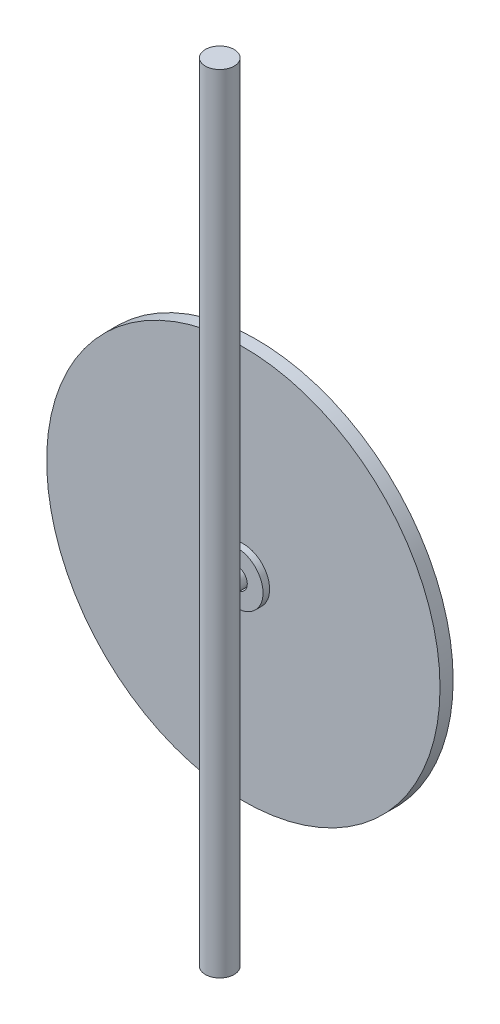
ISO-10303-21;
HEADER;
FILE_DESCRIPTION(('STEP AP214'),'2;1');
FILE_NAME('part.step','',(''),(''),'','','');
FILE_SCHEMA(('AUTOMOTIVE_DESIGN { 1 0 10303 214 1 1 1 1 }'));
ENDSEC;
DATA;
#1=APPLICATION_CONTEXT('core data for automotive mechanical design processes');
#2=APPLICATION_PROTOCOL_DEFINITION('international standard','automotive_design',2000,#1);
#3=PRODUCT_CONTEXT('',#1,'mechanical');
#4=PRODUCT('Part','Part','',(#3));
#5=PRODUCT_RELATED_PRODUCT_CATEGORY('part','',(#4));
#6=PRODUCT_DEFINITION_FORMATION('','',#4);
#7=PRODUCT_DEFINITION_CONTEXT('part definition',#1,'design');
#8=PRODUCT_DEFINITION('design','',#6,#7);
#9=PRODUCT_DEFINITION_SHAPE('','',#8);
#10=(LENGTH_UNIT() NAMED_UNIT(*) SI_UNIT(.MILLI.,.METRE.));
#11=(NAMED_UNIT(*) PLANE_ANGLE_UNIT() SI_UNIT($,.RADIAN.));
#12=(NAMED_UNIT(*) SI_UNIT($,.STERADIAN.) SOLID_ANGLE_UNIT());
#13=UNCERTAINTY_MEASURE_WITH_UNIT(LENGTH_MEASURE(1.E-05),#10,'distance_accuracy_value','');
#14=(GEOMETRIC_REPRESENTATION_CONTEXT(3) GLOBAL_UNCERTAINTY_ASSIGNED_CONTEXT((#13)) GLOBAL_UNIT_ASSIGNED_CONTEXT((#10,
#11,#12)) REPRESENTATION_CONTEXT('',''));
#15=CARTESIAN_POINT('',(0.,0.,0.));
#16=DIRECTION('',(0.,0.,1.));
#17=DIRECTION('',(1.,0.,0.));
#18=AXIS2_PLACEMENT_3D('',#15,#16,#17);
#19=CARTESIAN_POINT('',(99.9872894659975,-45.8993376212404,629.999999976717));
#20=DIRECTION('',(0.,0.,-1.));
#21=DIRECTION('',(-1.,0.,0.));
#22=AXIS2_PLACEMENT_3D('',#19,#20,#21);
#23=CYLINDRICAL_SURFACE('',#22,7.);
#24=CARTESIAN_POINT('',(99.9872894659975,-45.8993376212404,629.999999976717));
#25=DIRECTION('',(0.,0.,1.));
#26=DIRECTION('',(1.,0.,0.));
#27=AXIS2_PLACEMENT_3D('',#24,#25,#26);
#28=CIRCLE('',#27,7.);
#29=CARTESIAN_POINT('',(92.9872894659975,-45.8993376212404,629.999999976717));
#30=VERTEX_POINT('',#29);
#31=EDGE_CURVE('P0_E9',#30,#30,#28,.T.);
#32=CARTESIAN_POINT('',(99.9872894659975,-45.8993376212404,614.999999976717));
#33=DIRECTION('',(0.,0.,1.));
#34=DIRECTION('',(1.,0.,0.));
#35=AXIS2_PLACEMENT_3D('',#32,#33,#34);
#36=CIRCLE('',#35,7.);
#37=CARTESIAN_POINT('',(92.9872894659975,-45.8993376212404,614.999999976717));
#38=VERTEX_POINT('',#37);
#39=EDGE_CURVE('P0_E16',#38,#38,#36,.T.);
#40=CARTESIAN_POINT('',(92.9872894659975,-45.8993376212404,629.999999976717));
#41=CARTESIAN_POINT('',(92.9872894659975,-45.8993376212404,629.843749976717));
#42=CARTESIAN_POINT('',(92.9872894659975,-45.8993376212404,629.687499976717));
#43=CARTESIAN_POINT('',(92.9872894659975,-45.8993376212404,629.374999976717));
#44=CARTESIAN_POINT('',(92.9872894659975,-45.8993376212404,629.218749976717));
#45=CARTESIAN_POINT('',(92.9872894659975,-45.8993376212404,628.906249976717));
#46=CARTESIAN_POINT('',(92.9872894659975,-45.8993376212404,628.749999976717));
#47=CARTESIAN_POINT('',(92.9872894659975,-45.8993376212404,628.437499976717));
#48=CARTESIAN_POINT('',(92.9872894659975,-45.8993376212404,628.281249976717));
#49=CARTESIAN_POINT('',(92.9872894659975,-45.8993376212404,627.968749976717));
#50=CARTESIAN_POINT('',(92.9872894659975,-45.8993376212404,627.812499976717));
#51=CARTESIAN_POINT('',(92.9872894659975,-45.8993376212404,627.499999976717));
#52=CARTESIAN_POINT('',(92.9872894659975,-45.8993376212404,627.343749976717));
#53=CARTESIAN_POINT('',(92.9872894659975,-45.8993376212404,627.031249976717));
#54=CARTESIAN_POINT('',(92.9872894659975,-45.8993376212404,626.874999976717));
#55=CARTESIAN_POINT('',(92.9872894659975,-45.8993376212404,626.562499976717));
#56=CARTESIAN_POINT('',(92.9872894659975,-45.8993376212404,626.406249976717));
#57=CARTESIAN_POINT('',(92.9872894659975,-45.8993376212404,626.093749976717));
#58=CARTESIAN_POINT('',(92.9872894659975,-45.8993376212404,625.937499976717));
#59=CARTESIAN_POINT('',(92.9872894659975,-45.8993376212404,625.624999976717));
#60=CARTESIAN_POINT('',(92.9872894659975,-45.8993376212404,625.468749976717));
#61=CARTESIAN_POINT('',(92.9872894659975,-45.8993376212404,625.156249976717));
#62=CARTESIAN_POINT('',(92.9872894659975,-45.8993376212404,624.999999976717));
#63=CARTESIAN_POINT('',(92.9872894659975,-45.8993376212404,624.687499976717));
#64=CARTESIAN_POINT('',(92.9872894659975,-45.8993376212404,624.531249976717));
#65=CARTESIAN_POINT('',(92.9872894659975,-45.8993376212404,624.218749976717));
#66=CARTESIAN_POINT('',(92.9872894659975,-45.8993376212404,624.062499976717));
#67=CARTESIAN_POINT('',(92.9872894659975,-45.8993376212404,623.749999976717));
#68=CARTESIAN_POINT('',(92.9872894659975,-45.8993376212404,623.593749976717));
#69=CARTESIAN_POINT('',(92.9872894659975,-45.8993376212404,623.281249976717));
#70=CARTESIAN_POINT('',(92.9872894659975,-45.8993376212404,623.124999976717));
#71=CARTESIAN_POINT('',(92.9872894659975,-45.8993376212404,622.812499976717));
#72=CARTESIAN_POINT('',(92.9872894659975,-45.8993376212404,622.656249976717));
#73=CARTESIAN_POINT('',(92.9872894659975,-45.8993376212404,622.343749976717));
#74=CARTESIAN_POINT('',(92.9872894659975,-45.8993376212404,622.187499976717));
#75=CARTESIAN_POINT('',(92.9872894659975,-45.8993376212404,621.874999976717));
#76=CARTESIAN_POINT('',(92.9872894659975,-45.8993376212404,621.718749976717));
#77=CARTESIAN_POINT('',(92.9872894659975,-45.8993376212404,621.406249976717));
#78=CARTESIAN_POINT('',(92.9872894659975,-45.8993376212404,621.249999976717));
#79=CARTESIAN_POINT('',(92.9872894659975,-45.8993376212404,620.937499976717));
#80=CARTESIAN_POINT('',(92.9872894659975,-45.8993376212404,620.781249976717));
#81=CARTESIAN_POINT('',(92.9872894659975,-45.8993376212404,620.468749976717));
#82=CARTESIAN_POINT('',(92.9872894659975,-45.8993376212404,620.312499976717));
#83=CARTESIAN_POINT('',(92.9872894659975,-45.8993376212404,619.999999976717));
#84=CARTESIAN_POINT('',(92.9872894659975,-45.8993376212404,619.843749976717));
#85=CARTESIAN_POINT('',(92.9872894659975,-45.8993376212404,619.531249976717));
#86=CARTESIAN_POINT('',(92.9872894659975,-45.8993376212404,619.374999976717));
#87=CARTESIAN_POINT('',(92.9872894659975,-45.8993376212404,619.062499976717));
#88=CARTESIAN_POINT('',(92.9872894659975,-45.8993376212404,618.906249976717));
#89=CARTESIAN_POINT('',(92.9872894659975,-45.8993376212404,618.593749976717));
#90=CARTESIAN_POINT('',(92.9872894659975,-45.8993376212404,618.437499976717));
#91=CARTESIAN_POINT('',(92.9872894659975,-45.8993376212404,618.124999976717));
#92=CARTESIAN_POINT('',(92.9872894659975,-45.8993376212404,617.968749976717));
#93=CARTESIAN_POINT('',(92.9872894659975,-45.8993376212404,617.656249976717));
#94=CARTESIAN_POINT('',(92.9872894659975,-45.8993376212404,617.499999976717));
#95=CARTESIAN_POINT('',(92.9872894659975,-45.8993376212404,617.187499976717));
#96=CARTESIAN_POINT('',(92.9872894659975,-45.8993376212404,617.031249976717));
#97=CARTESIAN_POINT('',(92.9872894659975,-45.8993376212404,616.718749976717));
#98=CARTESIAN_POINT('',(92.9872894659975,-45.8993376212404,616.562499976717));
#99=CARTESIAN_POINT('',(92.9872894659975,-45.8993376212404,616.249999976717));
#100=CARTESIAN_POINT('',(92.9872894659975,-45.8993376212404,616.093749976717));
#101=CARTESIAN_POINT('',(92.9872894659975,-45.8993376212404,615.781249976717));
#102=CARTESIAN_POINT('',(92.9872894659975,-45.8993376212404,615.624999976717));
#103=CARTESIAN_POINT('',(92.9872894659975,-45.8993376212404,615.312499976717));
#104=CARTESIAN_POINT('',(92.9872894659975,-45.8993376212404,615.156249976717));
#105=CARTESIAN_POINT('',(92.9872894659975,-45.8993376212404,614.999999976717));
#106=B_SPLINE_CURVE_WITH_KNOTS('',3,(#40,#41,#42,#43,#44,#45,#46,#47,#48,#49,#50,#51,#52,#53,
#54,#55,#56,#57,#58,#59,#60,#61,#62,#63,#64,#65,#66,#67,#68,#69,#70,#71,#72,#73,#74,#75,#76,#77,
#78,#79,#80,#81,#82,#83,#84,#85,#86,#87,#88,#89,#90,#91,#92,#93,#94,#95,#96,#97,#98,#99,#100,
#101,#102,#103,#104,#105),.UNSPECIFIED.,.F.,.F.,(4,2,2,2,2,2,2,2,2,2,2,2,2,2,2,2,2,2,2,2,2,2,2,
2,2,2,2,2,2,2,2,2,4),(0.,0.468749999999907,0.937499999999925,1.40624999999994,1.87499999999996,
2.34374999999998,2.8125,3.2812499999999,3.74999999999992,4.21874999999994,4.68749999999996,
5.15624999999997,5.62499999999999,6.0937499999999,6.56249999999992,7.03124999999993,
7.49999999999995,7.96874999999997,8.43749999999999,8.90625,9.37499999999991,9.84374999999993,
10.3124999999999,10.78125,11.25,11.71875,12.1874999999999,12.6562499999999,13.1249999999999,
13.59375,14.0625,14.53125,14.9999999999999),.UNSPECIFIED.);
#107=EDGE_CURVE('P0_BSEAM13',#30,#38,#106,.T.);
#108=ORIENTED_EDGE('',*,*,#31,.F.);
#109=ORIENTED_EDGE('',*,*,#39,.T.);
#110=ORIENTED_EDGE('',*,*,#107,.T.);
#111=ORIENTED_EDGE('',*,*,#107,.F.);
#112=EDGE_LOOP('',(#108,#110,#109,#111));
#113=FACE_BOUND('',#112,.T.);
#114=ADVANCED_FACE('P0_F13',(#113),#23,.T.);
#115=CARTESIAN_POINT('',(99.9872894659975,-45.8993376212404,629.999999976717));
#116=DIRECTION('',(0.,0.,1.));
#117=DIRECTION('',(1.,0.,0.));
#118=AXIS2_PLACEMENT_3D('',#115,#116,#117);
#119=PLANE('',#118);
#120=CARTESIAN_POINT('',(99.9872894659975,-45.8993376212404,629.999999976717));
#121=DIRECTION('',(0.,0.,1.));
#122=DIRECTION('',(1.,0.,0.));
#123=AXIS2_PLACEMENT_3D('',#120,#121,#122);
#124=CIRCLE('',#123,6.);
#125=CARTESIAN_POINT('',(105.987289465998,-45.8993376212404,629.999999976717));
#126=VERTEX_POINT('',#125);
#127=EDGE_CURVE('P0_E25',#126,#126,#124,.T.);
#128=ORIENTED_EDGE('',*,*,#127,.F.);
#129=EDGE_LOOP('',(#128));
#130=FACE_BOUND('',#129,.T.);
#131=ORIENTED_EDGE('',*,*,#31,.T.);
#132=EDGE_LOOP('',(#131));
#133=FACE_BOUND('',#132,.T.);
#134=ADVANCED_FACE('P0_F40',(#130,#133),#119,.T.);
#135=CARTESIAN_POINT('',(99.9872894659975,-45.8993376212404,614.999999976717));
#136=DIRECTION('',(0.,0.,1.));
#137=DIRECTION('',(1.,0.,0.));
#138=AXIS2_PLACEMENT_3D('',#135,#136,#137);
#139=PLANE('',#138);
#140=ORIENTED_EDGE('',*,*,#39,.F.);
#141=EDGE_LOOP('',(#140));
#142=FACE_BOUND('',#141,.T.);
#143=ADVANCED_FACE('P0_F36',(#142),#139,.F.);
#144=CARTESIAN_POINT('',(99.9872894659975,-45.8993376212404,619.999999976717));
#145=DIRECTION('',(0.,0.,1.));
#146=DIRECTION('',(1.,0.,0.));
#147=AXIS2_PLACEMENT_3D('',#144,#145,#146);
#148=CYLINDRICAL_SURFACE('',#147,6.);
#149=CARTESIAN_POINT('',(99.9872894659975,-45.8993376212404,619.999999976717));
#150=DIRECTION('',(0.,0.,1.));
#151=DIRECTION('',(1.,0.,0.));
#152=AXIS2_PLACEMENT_3D('',#149,#150,#151);
#153=CIRCLE('',#152,6.);
#154=CARTESIAN_POINT('',(105.987289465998,-45.8993376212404,619.999999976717));
#155=VERTEX_POINT('',#154);
#156=EDGE_CURVE('P0_E23',#155,#155,#153,.T.);
#157=ORIENTED_EDGE('',*,*,#156,.F.);
#158=EDGE_LOOP('',(#157));
#159=FACE_BOUND('',#158,.T.);
#160=ORIENTED_EDGE('',*,*,#127,.T.);
#161=EDGE_LOOP('',(#160));
#162=FACE_BOUND('',#161,.T.);
#163=ADVANCED_FACE('P0_F33',(#159,#162),#148,.F.);
#164=CARTESIAN_POINT('',(99.9872894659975,-45.8993376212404,619.999999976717));
#165=DIRECTION('',(0.,0.,1.));
#166=DIRECTION('',(1.,0.,0.));
#167=AXIS2_PLACEMENT_3D('',#164,#165,#166);
#168=PLANE('',#167);
#169=ORIENTED_EDGE('',*,*,#156,.T.);
#170=EDGE_LOOP('',(#169));
#171=FACE_BOUND('',#170,.T.);
#172=ADVANCED_FACE('P0_F31',(#171),#168,.T.);
#173=CLOSED_SHELL('',(#114,#134,#143,#163,#172));
#174=MANIFOLD_SOLID_BREP('P0_B1',#173);
#175=CARTESIAN_POINT('',(99.9872894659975,-45.8993376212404,624.999999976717));
#176=DIRECTION('',(0.,0.,1.));
#177=DIRECTION('',(1.,0.,0.));
#178=AXIS2_PLACEMENT_3D('',#175,#176,#177);
#179=PLANE('',#178);
#180=CARTESIAN_POINT('',(99.9872894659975,-45.8993376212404,624.999999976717));
#181=DIRECTION('',(0.,0.,1.));
#182=DIRECTION('',(1.,0.,0.));
#183=AXIS2_PLACEMENT_3D('',#180,#181,#182);
#184=CIRCLE('',#183,20.);
#185=CARTESIAN_POINT('',(119.987289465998,-45.8993376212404,624.999999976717));
#186=VERTEX_POINT('',#185);
#187=EDGE_CURVE('P1_E10',#186,#186,#184,.T.);
#188=ORIENTED_EDGE('',*,*,#187,.T.);
#189=EDGE_LOOP('',(#188));
#190=FACE_BOUND('',#189,.T.);
#191=CARTESIAN_POINT('',(99.9872894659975,-45.8993376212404,624.999999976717));
#192=DIRECTION('',(0.,0.,1.));
#193=DIRECTION('',(1.,0.,0.));
#194=AXIS2_PLACEMENT_3D('',#191,#192,#193);
#195=CIRCLE('',#194,8.);
#196=CARTESIAN_POINT('',(107.987289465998,-45.8993376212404,624.999999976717));
#197=VERTEX_POINT('',#196);
#198=EDGE_CURVE('P1_E25',#197,#197,#195,.T.);
#199=ORIENTED_EDGE('',*,*,#198,.F.);
#200=EDGE_LOOP('',(#199));
#201=FACE_BOUND('',#200,.T.);
#202=ADVANCED_FACE('P1_F14',(#190,#201),#179,.T.);
#203=CARTESIAN_POINT('',(99.9872894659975,-45.8993376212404,619.999999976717));
#204=DIRECTION('',(0.,0.,1.));
#205=DIRECTION('',(1.,0.,0.));
#206=AXIS2_PLACEMENT_3D('',#203,#204,#205);
#207=PLANE('',#206);
#208=CARTESIAN_POINT('',(99.9872894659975,-45.8993376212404,619.999999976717));
#209=DIRECTION('',(0.,0.,1.));
#210=DIRECTION('',(1.,0.,0.));
#211=AXIS2_PLACEMENT_3D('',#208,#209,#210);
#212=CIRCLE('',#211,20.);
#213=CARTESIAN_POINT('',(119.987289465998,-45.8993376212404,619.999999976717));
#214=VERTEX_POINT('',#213);
#215=EDGE_CURVE('P1_E18',#214,#214,#212,.T.);
#216=ORIENTED_EDGE('',*,*,#215,.F.);
#217=EDGE_LOOP('',(#216));
#218=FACE_BOUND('',#217,.T.);
#219=CARTESIAN_POINT('',(99.9872894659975,-45.8993376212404,619.999999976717));
#220=DIRECTION('',(0.,0.,1.));
#221=DIRECTION('',(1.,0.,0.));
#222=AXIS2_PLACEMENT_3D('',#219,#220,#221);
#223=CIRCLE('',#222,8.);
#224=CARTESIAN_POINT('',(107.987289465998,-45.8993376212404,619.999999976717));
#225=VERTEX_POINT('',#224);
#226=EDGE_CURVE('P1_E27',#225,#225,#223,.T.);
#227=ORIENTED_EDGE('',*,*,#226,.T.);
#228=EDGE_LOOP('',(#227));
#229=FACE_BOUND('',#228,.T.);
#230=ADVANCED_FACE('P1_F37',(#218,#229),#207,.F.);
#231=CARTESIAN_POINT('',(99.9872894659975,-45.8993376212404,624.999999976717));
#232=DIRECTION('',(0.,0.,-1.));
#233=DIRECTION('',(-1.,0.,0.));
#234=AXIS2_PLACEMENT_3D('',#231,#232,#233);
#235=CYLINDRICAL_SURFACE('',#234,20.);
#236=ORIENTED_EDGE('',*,*,#187,.F.);
#237=EDGE_LOOP('',(#236));
#238=FACE_BOUND('',#237,.T.);
#239=ORIENTED_EDGE('',*,*,#215,.T.);
#240=EDGE_LOOP('',(#239));
#241=FACE_BOUND('',#240,.T.);
#242=ADVANCED_FACE('P1_F16',(#238,#241),#235,.T.);
#243=CARTESIAN_POINT('',(99.9872894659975,-45.8993376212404,624.999999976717));
#244=DIRECTION('',(0.,0.,-1.));
#245=DIRECTION('',(-1.,0.,0.));
#246=AXIS2_PLACEMENT_3D('',#243,#244,#245);
#247=CYLINDRICAL_SURFACE('',#246,8.);
#248=ORIENTED_EDGE('',*,*,#198,.T.);
#249=EDGE_LOOP('',(#248));
#250=FACE_BOUND('',#249,.T.);
#251=ORIENTED_EDGE('',*,*,#226,.F.);
#252=EDGE_LOOP('',(#251));
#253=FACE_BOUND('',#252,.T.);
#254=ADVANCED_FACE('P1_F33',(#250,#253),#247,.F.);
#255=CLOSED_SHELL('',(#202,#230,#242,#254));
#256=MANIFOLD_SOLID_BREP('P1_B1',#255);
#257=CARTESIAN_POINT('',(99.9872894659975,-45.8993376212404,619.999999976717));
#258=DIRECTION('',(0.,0.,-1.));
#259=DIRECTION('',(-1.,0.,0.));
#260=AXIS2_PLACEMENT_3D('',#257,#258,#259);
#261=CYLINDRICAL_SURFACE('',#260,150.);
#262=CARTESIAN_POINT('',(99.9872894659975,-45.8993376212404,619.999999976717));
#263=DIRECTION('',(0.,0.,1.));
#264=DIRECTION('',(1.,0.,0.));
#265=AXIS2_PLACEMENT_3D('',#262,#263,#264);
#266=CIRCLE('',#265,150.);
#267=CARTESIAN_POINT('',(249.987289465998,-45.8993376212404,619.999999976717));
#268=VERTEX_POINT('',#267);
#269=EDGE_CURVE('P2_E10',#268,#268,#266,.T.);
#270=ORIENTED_EDGE('',*,*,#269,.F.);
#271=EDGE_LOOP('',(#270));
#272=FACE_BOUND('',#271,.T.);
#273=CARTESIAN_POINT('',(99.9872894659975,-45.8993376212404,609.999999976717));
#274=DIRECTION('',(0.,0.,1.));
#275=DIRECTION('',(1.,0.,0.));
#276=AXIS2_PLACEMENT_3D('',#273,#274,#275);
#277=CIRCLE('',#276,150.);
#278=CARTESIAN_POINT('',(249.987289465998,-45.8993376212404,609.999999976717));
#279=VERTEX_POINT('',#278);
#280=EDGE_CURVE('P2_E17',#279,#279,#277,.T.);
#281=ORIENTED_EDGE('',*,*,#280,.T.);
#282=EDGE_LOOP('',(#281));
#283=FACE_BOUND('',#282,.T.);
#284=ADVANCED_FACE('P2_F14',(#272,#283),#261,.T.);
#285=CARTESIAN_POINT('',(99.9872894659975,-45.8993376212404,619.999999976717));
#286=DIRECTION('',(0.,0.,1.));
#287=DIRECTION('',(1.,0.,0.));
#288=AXIS2_PLACEMENT_3D('',#285,#286,#287);
#289=PLANE('',#288);
#290=CARTESIAN_POINT('',(99.9872894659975,-45.8993376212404,619.999999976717));
#291=DIRECTION('',(0.,0.,1.));
#292=DIRECTION('',(1.,0.,0.));
#293=AXIS2_PLACEMENT_3D('',#290,#291,#292);
#294=CIRCLE('',#293,7.);
#295=CARTESIAN_POINT('',(106.987289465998,-45.8993376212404,619.999999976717));
#296=VERTEX_POINT('',#295);
#297=EDGE_CURVE('P2_E26',#296,#296,#294,.T.);
#298=ORIENTED_EDGE('',*,*,#297,.F.);
#299=EDGE_LOOP('',(#298));
#300=FACE_BOUND('',#299,.T.);
#301=ORIENTED_EDGE('',*,*,#269,.T.);
#302=EDGE_LOOP('',(#301));
#303=FACE_BOUND('',#302,.T.);
#304=ADVANCED_FACE('P2_F41',(#300,#303),#289,.T.);
#305=CARTESIAN_POINT('',(99.9872894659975,-45.8993376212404,609.999999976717));
#306=DIRECTION('',(0.,0.,1.));
#307=DIRECTION('',(1.,0.,0.));
#308=AXIS2_PLACEMENT_3D('',#305,#306,#307);
#309=PLANE('',#308);
#310=ORIENTED_EDGE('',*,*,#280,.F.);
#311=EDGE_LOOP('',(#310));
#312=FACE_BOUND('',#311,.T.);
#313=ADVANCED_FACE('P2_F37',(#312),#309,.F.);
#314=CARTESIAN_POINT('',(99.9872894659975,-45.8993376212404,614.999999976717));
#315=DIRECTION('',(0.,0.,1.));
#316=DIRECTION('',(1.,0.,0.));
#317=AXIS2_PLACEMENT_3D('',#314,#315,#316);
#318=CYLINDRICAL_SURFACE('',#317,7.);
#319=CARTESIAN_POINT('',(99.9872894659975,-45.8993376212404,614.999999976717));
#320=DIRECTION('',(0.,0.,1.));
#321=DIRECTION('',(1.,0.,0.));
#322=AXIS2_PLACEMENT_3D('',#319,#320,#321);
#323=CIRCLE('',#322,7.);
#324=CARTESIAN_POINT('',(106.987289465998,-45.8993376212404,614.999999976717));
#325=VERTEX_POINT('',#324);
#326=EDGE_CURVE('P2_E24',#325,#325,#323,.T.);
#327=ORIENTED_EDGE('',*,*,#326,.F.);
#328=EDGE_LOOP('',(#327));
#329=FACE_BOUND('',#328,.T.);
#330=ORIENTED_EDGE('',*,*,#297,.T.);
#331=EDGE_LOOP('',(#330));
#332=FACE_BOUND('',#331,.T.);
#333=ADVANCED_FACE('P2_F34',(#329,#332),#318,.F.);
#334=CARTESIAN_POINT('',(99.9872894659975,-45.8993376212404,614.999999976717));
#335=DIRECTION('',(0.,0.,1.));
#336=DIRECTION('',(1.,0.,0.));
#337=AXIS2_PLACEMENT_3D('',#334,#335,#336);
#338=PLANE('',#337);
#339=ORIENTED_EDGE('',*,*,#326,.T.);
#340=EDGE_LOOP('',(#339));
#341=FACE_BOUND('',#340,.T.);
#342=ADVANCED_FACE('P2_F32',(#341),#338,.T.);
#343=CLOSED_SHELL('',(#284,#304,#313,#333,#342));
#344=MANIFOLD_SOLID_BREP('P2_B1',#343);
#345=CARTESIAN_POINT('',(99.9872894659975,-45.8993376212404,609.999999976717));
#346=DIRECTION('',(0.,0.,-1.));
#347=DIRECTION('',(-1.,0.,0.));
#348=AXIS2_PLACEMENT_3D('',#345,#346,#347);
#349=CYLINDRICAL_SURFACE('',#348,25.);
#350=CARTESIAN_POINT('',(99.9872894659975,-45.8993376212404,609.999999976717));
#351=DIRECTION('',(0.,0.,1.));
#352=DIRECTION('',(1.,0.,0.));
#353=AXIS2_PLACEMENT_3D('',#350,#351,#352);
#354=CIRCLE('',#353,25.);
#355=CARTESIAN_POINT('',(124.987289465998,-45.8993376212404,609.999999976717));
#356=VERTEX_POINT('',#355);
#357=EDGE_CURVE('P3_E10',#356,#356,#354,.T.);
#358=ORIENTED_EDGE('',*,*,#357,.F.);
#359=EDGE_LOOP('',(#358));
#360=FACE_BOUND('',#359,.T.);
#361=CARTESIAN_POINT('',(99.9872894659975,-45.8993376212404,599.999999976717));
#362=DIRECTION('',(0.,0.,1.));
#363=DIRECTION('',(1.,0.,0.));
#364=AXIS2_PLACEMENT_3D('',#361,#362,#363);
#365=CIRCLE('',#364,25.);
#366=CARTESIAN_POINT('',(124.987289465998,-45.8993376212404,599.999999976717));
#367=VERTEX_POINT('',#366);
#368=EDGE_CURVE('P3_E17',#367,#367,#365,.T.);
#369=ORIENTED_EDGE('',*,*,#368,.T.);
#370=EDGE_LOOP('',(#369));
#371=FACE_BOUND('',#370,.T.);
#372=ADVANCED_FACE('P3_F14',(#360,#371),#349,.T.);
#373=CARTESIAN_POINT('',(99.9872894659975,-45.8993376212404,609.999999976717));
#374=DIRECTION('',(0.,0.,1.));
#375=DIRECTION('',(1.,0.,0.));
#376=AXIS2_PLACEMENT_3D('',#373,#374,#375);
#377=PLANE('',#376);
#378=ORIENTED_EDGE('',*,*,#357,.T.);
#379=EDGE_LOOP('',(#378));
#380=FACE_BOUND('',#379,.T.);
#381=ADVANCED_FACE('P3_F29',(#380),#377,.T.);
#382=CARTESIAN_POINT('',(99.9872894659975,-45.8993376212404,599.999999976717));
#383=DIRECTION('',(0.,0.,1.));
#384=DIRECTION('',(1.,0.,0.));
#385=AXIS2_PLACEMENT_3D('',#382,#383,#384);
#386=PLANE('',#385);
#387=ORIENTED_EDGE('',*,*,#368,.F.);
#388=EDGE_LOOP('',(#387));
#389=FACE_BOUND('',#388,.T.);
#390=ADVANCED_FACE('P3_F27',(#389),#386,.F.);
#391=CLOSED_SHELL('',(#372,#381,#390));
#392=MANIFOLD_SOLID_BREP('P3_B1',#391);
#393=CARTESIAN_POINT('',(99.9872894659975,-45.8993376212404,599.999999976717));
#394=DIRECTION('',(0.,0.,-1.));
#395=DIRECTION('',(-1.,0.,0.));
#396=AXIS2_PLACEMENT_3D('',#393,#394,#395);
#397=CYLINDRICAL_SURFACE('',#396,75.);
#398=CARTESIAN_POINT('',(99.9872894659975,-45.8993376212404,599.999999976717));
#399=DIRECTION('',(0.,0.,1.));
#400=DIRECTION('',(1.,0.,0.));
#401=AXIS2_PLACEMENT_3D('',#398,#399,#400);
#402=CIRCLE('',#401,75.);
#403=CARTESIAN_POINT('',(174.987289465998,-45.8993376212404,599.999999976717));
#404=VERTEX_POINT('',#403);
#405=EDGE_CURVE('P4_E10',#404,#404,#402,.T.);
#406=ORIENTED_EDGE('',*,*,#405,.F.);
#407=EDGE_LOOP('',(#406));
#408=FACE_BOUND('',#407,.T.);
#409=CARTESIAN_POINT('',(99.9872894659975,-45.8993376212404,569.999999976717));
#410=DIRECTION('',(0.,0.,1.));
#411=DIRECTION('',(1.,0.,0.));
#412=AXIS2_PLACEMENT_3D('',#409,#410,#411);
#413=CIRCLE('',#412,75.);
#414=CARTESIAN_POINT('',(174.987289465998,-45.8993376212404,569.999999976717));
#415=VERTEX_POINT('',#414);
#416=EDGE_CURVE('P4_E17',#415,#415,#413,.T.);
#417=ORIENTED_EDGE('',*,*,#416,.T.);
#418=EDGE_LOOP('',(#417));
#419=FACE_BOUND('',#418,.T.);
#420=ADVANCED_FACE('P4_F14',(#408,#419),#397,.T.);
#421=CARTESIAN_POINT('',(99.9872894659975,-45.8993376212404,599.999999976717));
#422=DIRECTION('',(0.,0.,1.));
#423=DIRECTION('',(1.,0.,0.));
#424=AXIS2_PLACEMENT_3D('',#421,#422,#423);
#425=PLANE('',#424);
#426=ORIENTED_EDGE('',*,*,#405,.T.);
#427=EDGE_LOOP('',(#426));
#428=FACE_BOUND('',#427,.T.);
#429=ADVANCED_FACE('P4_F29',(#428),#425,.T.);
#430=CARTESIAN_POINT('',(99.9872894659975,-45.8993376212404,569.999999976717));
#431=DIRECTION('',(0.,0.,1.));
#432=DIRECTION('',(1.,0.,0.));
#433=AXIS2_PLACEMENT_3D('',#430,#431,#432);
#434=PLANE('',#433);
#435=ORIENTED_EDGE('',*,*,#416,.F.);
#436=EDGE_LOOP('',(#435));
#437=FACE_BOUND('',#436,.T.);
#438=ADVANCED_FACE('P4_F27',(#437),#434,.F.);
#439=CLOSED_SHELL('',(#420,#429,#438));
#440=MANIFOLD_SOLID_BREP('P4_B1',#439);
#441=CARTESIAN_POINT('',(99.9872894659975,-45.8993376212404,619.999999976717));
#442=DIRECTION('',(0.,0.,1.));
#443=DIRECTION('',(1.,0.,0.));
#444=AXIS2_PLACEMENT_3D('',#441,#442,#443);
#445=CYLINDRICAL_SURFACE('',#444,6.);
#446=CARTESIAN_POINT('',(99.9872894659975,-45.8993376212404,619.999999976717));
#447=DIRECTION('',(0.,0.,-1.));
#448=DIRECTION('',(-1.,0.,0.));
#449=AXIS2_PLACEMENT_3D('',#446,#447,#448);
#450=CIRCLE('',#449,6.);
#451=CARTESIAN_POINT('',(93.9872894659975,-45.8993376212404,619.999999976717));
#452=VERTEX_POINT('',#451);
#453=EDGE_CURVE('P5_E10',#452,#452,#450,.T.);
#454=ORIENTED_EDGE('',*,*,#453,.F.);
#455=EDGE_LOOP('',(#454));
#456=FACE_BOUND('',#455,.T.);
#457=CARTESIAN_POINT('',(99.9872894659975,-45.8993376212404,629.999999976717));
#458=DIRECTION('',(0.,0.,-1.));
#459=DIRECTION('',(-1.,0.,0.));
#460=AXIS2_PLACEMENT_3D('',#457,#458,#459);
#461=CIRCLE('',#460,6.);
#462=CARTESIAN_POINT('',(93.9872894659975,-45.8993376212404,629.999999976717));
#463=VERTEX_POINT('',#462);
#464=EDGE_CURVE('P5_E17',#463,#463,#461,.T.);
#465=ORIENTED_EDGE('',*,*,#464,.T.);
#466=EDGE_LOOP('',(#465));
#467=FACE_BOUND('',#466,.T.);
#468=ADVANCED_FACE('P5_F14',(#456,#467),#445,.T.);
#469=CARTESIAN_POINT('',(99.9872894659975,-45.8993376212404,619.999999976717));
#470=DIRECTION('',(0.,0.,-1.));
#471=DIRECTION('',(-1.,0.,0.));
#472=AXIS2_PLACEMENT_3D('',#469,#470,#471);
#473=PLANE('',#472);
#474=ORIENTED_EDGE('',*,*,#453,.T.);
#475=EDGE_LOOP('',(#474));
#476=FACE_BOUND('',#475,.T.);
#477=ADVANCED_FACE('P5_F29',(#476),#473,.T.);
#478=CARTESIAN_POINT('',(99.9872894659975,-45.8993376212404,629.999999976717));
#479=DIRECTION('',(0.,0.,-1.));
#480=DIRECTION('',(-1.,0.,0.));
#481=AXIS2_PLACEMENT_3D('',#478,#479,#480);
#482=PLANE('',#481);
#483=ORIENTED_EDGE('',*,*,#464,.F.);
#484=EDGE_LOOP('',(#483));
#485=FACE_BOUND('',#484,.T.);
#486=ADVANCED_FACE('P5_F27',(#485),#482,.F.);
#487=CLOSED_SHELL('',(#468,#477,#486));
#488=MANIFOLD_SOLID_BREP('P5_B1',#487);
#489=CARTESIAN_POINT('',(99.9872894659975,-295.89933762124,637.999999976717));
#490=DIRECTION('',(0.,1.,0.));
#491=DIRECTION('',(1.,0.,0.));
#492=AXIS2_PLACEMENT_3D('',#489,#490,#491);
#493=CYLINDRICAL_SURFACE('',#492,11.);
#494=CARTESIAN_POINT('',(99.9872894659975,284.10066237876,637.999999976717));
#495=DIRECTION('',(0.,1.,0.));
#496=DIRECTION('',(1.,0.,0.));
#497=AXIS2_PLACEMENT_3D('',#494,#495,#496);
#498=CIRCLE('',#497,11.);
#499=CARTESIAN_POINT('',(92.4374550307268,284.10066237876,629.999999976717));
#500=VERTEX_POINT('',#499);
#501=CARTESIAN_POINT('',(107.537123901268,284.10066237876,629.999999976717));
#502=VERTEX_POINT('',#501);
#503=EDGE_CURVE('P6_E10',#500,#502,#498,.F.);
#504=ORIENTED_EDGE('',*,*,#503,.F.);
#505=DIRECTION('',(0.,1.,0.));
#506=VECTOR('',#505,1.);
#507=CARTESIAN_POINT('',(92.4374550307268,-295.89933762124,629.999999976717));
#508=LINE('',#507,#506);
#509=CARTESIAN_POINT('',(92.4374550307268,-275.89933762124,629.999999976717));
#510=VERTEX_POINT('',#509);
#511=EDGE_CURVE('P6_E22',#500,#510,#508,.F.);
#512=ORIENTED_EDGE('',*,*,#511,.T.);
#513=CARTESIAN_POINT('',(99.9872894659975,-275.89933762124,637.999999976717));
#514=DIRECTION('',(0.,1.,0.));
#515=DIRECTION('',(1.,0.,0.));
#516=AXIS2_PLACEMENT_3D('',#513,#514,#515);
#517=CIRCLE('',#516,11.);
#518=CARTESIAN_POINT('',(107.537123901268,-275.89933762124,629.999999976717));
#519=VERTEX_POINT('',#518);
#520=EDGE_CURVE('P6_E40',#510,#519,#517,.F.);
#521=ORIENTED_EDGE('',*,*,#520,.T.);
#522=DIRECTION('',(0.,1.,0.));
#523=VECTOR('',#522,1.);
#524=CARTESIAN_POINT('',(107.537123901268,-295.89933762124,629.999999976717));
#525=LINE('',#524,#523);
#526=EDGE_CURVE('P6_E45',#519,#502,#525,.T.);
#527=ORIENTED_EDGE('',*,*,#526,.T.);
#528=EDGE_LOOP('',(#504,#512,#521,#527));
#529=FACE_BOUND('',#528,.T.);
#530=CARTESIAN_POINT('',(99.9872894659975,-295.89933762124,637.999999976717));
#531=DIRECTION('',(0.,1.,0.));
#532=DIRECTION('',(1.,0.,0.));
#533=AXIS2_PLACEMENT_3D('',#530,#531,#532);
#534=CIRCLE('',#533,11.);
#535=CARTESIAN_POINT('',(110.987289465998,-295.89933762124,637.999999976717));
#536=VERTEX_POINT('',#535);
#537=EDGE_CURVE('P6_E46',#536,#536,#534,.T.);
#538=ORIENTED_EDGE('',*,*,#537,.T.);
#539=EDGE_LOOP('',(#538));
#540=FACE_BOUND('',#539,.T.);
#541=CARTESIAN_POINT('',(99.9872894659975,304.10066237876,637.999999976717));
#542=DIRECTION('',(0.,1.,0.));
#543=DIRECTION('',(1.,0.,0.));
#544=AXIS2_PLACEMENT_3D('',#541,#542,#543);
#545=CIRCLE('',#544,11.);
#546=CARTESIAN_POINT('',(110.987289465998,304.10066237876,637.999999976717));
#547=VERTEX_POINT('',#546);
#548=EDGE_CURVE('P6_E57',#547,#547,#545,.T.);
#549=ORIENTED_EDGE('',*,*,#548,.F.);
#550=EDGE_LOOP('',(#549));
#551=FACE_BOUND('',#550,.T.);
#552=ADVANCED_FACE('P6_F15',(#529,#540,#551),#493,.T.);
#553=CARTESIAN_POINT('',(99.9872894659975,-295.89933762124,637.999999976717));
#554=DIRECTION('',(0.,1.,0.));
#555=DIRECTION('',(1.,0.,0.));
#556=AXIS2_PLACEMENT_3D('',#553,#554,#555);
#557=PLANE('',#556);
#558=ORIENTED_EDGE('',*,*,#537,.F.);
#559=EDGE_LOOP('',(#558));
#560=FACE_BOUND('',#559,.T.);
#561=ADVANCED_FACE('P6_F72',(#560),#557,.F.);
#562=CARTESIAN_POINT('',(99.9872894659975,304.10066237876,637.999999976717));
#563=DIRECTION('',(0.,1.,0.));
#564=DIRECTION('',(1.,0.,0.));
#565=AXIS2_PLACEMENT_3D('',#562,#563,#564);
#566=PLANE('',#565);
#567=ORIENTED_EDGE('',*,*,#548,.T.);
#568=EDGE_LOOP('',(#567));
#569=FACE_BOUND('',#568,.T.);
#570=ADVANCED_FACE('P6_F69',(#569),#566,.T.);
#571=CARTESIAN_POINT('',(112.787386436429,284.10066237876,629.999999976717));
#572=DIRECTION('',(0.,0.,-1.));
#573=DIRECTION('',(-1.,0.,0.));
#574=AXIS2_PLACEMENT_3D('',#571,#572,#573);
#575=PLANE('',#574);
#576=DIRECTION('',(1.,0.,0.));
#577=VECTOR('',#576,1.);
#578=CARTESIAN_POINT('',(112.787386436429,284.10066237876,629.999999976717));
#579=LINE('',#578,#577);
#580=EDGE_CURVE('P6_E50',#500,#502,#579,.T.);
#581=ORIENTED_EDGE('',*,*,#580,.T.);
#582=ORIENTED_EDGE('',*,*,#526,.F.);
#583=DIRECTION('',(1.,0.,0.));
#584=VECTOR('',#583,1.);
#585=CARTESIAN_POINT('',(112.787386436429,-275.89933762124,629.999999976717));
#586=LINE('',#585,#584);
#587=EDGE_CURVE('P6_E28',#510,#519,#586,.T.);
#588=ORIENTED_EDGE('',*,*,#587,.F.);
#589=ORIENTED_EDGE('',*,*,#511,.F.);
#590=EDGE_LOOP('',(#581,#582,#588,#589));
#591=FACE_BOUND('',#590,.T.);
#592=ADVANCED_FACE('P6_F49',(#591),#575,.T.);
#593=CARTESIAN_POINT('',(99.9872894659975,284.10066237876,637.999999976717));
#594=DIRECTION('',(0.,1.,0.));
#595=DIRECTION('',(1.,0.,0.));
#596=AXIS2_PLACEMENT_3D('',#593,#594,#595);
#597=PLANE('',#596);
#598=ORIENTED_EDGE('',*,*,#503,.T.);
#599=ORIENTED_EDGE('',*,*,#580,.F.);
#600=EDGE_LOOP('',(#598,#599));
#601=FACE_BOUND('',#600,.T.);
#602=ADVANCED_FACE('P6_F60',(#601),#597,.F.);
#603=CARTESIAN_POINT('',(99.9872894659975,-275.89933762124,637.999999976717));
#604=DIRECTION('',(0.,1.,0.));
#605=DIRECTION('',(1.,0.,0.));
#606=AXIS2_PLACEMENT_3D('',#603,#604,#605);
#607=PLANE('',#606);
#608=ORIENTED_EDGE('',*,*,#587,.T.);
#609=ORIENTED_EDGE('',*,*,#520,.F.);
#610=EDGE_LOOP('',(#608,#609));
#611=FACE_BOUND('',#610,.T.);
#612=ADVANCED_FACE('P6_F41',(#611),#607,.T.);
#613=CLOSED_SHELL('',(#552,#561,#570,#592,#602,#612));
#614=MANIFOLD_SOLID_BREP('P6_B1',#613);
#615=ADVANCED_BREP_SHAPE_REPRESENTATION('',(#18,#174,#256,#344,#392,#440,#488,#614),#14);
#616=SHAPE_DEFINITION_REPRESENTATION(#9,#615);
ENDSEC;
END-ISO-10303-21;
